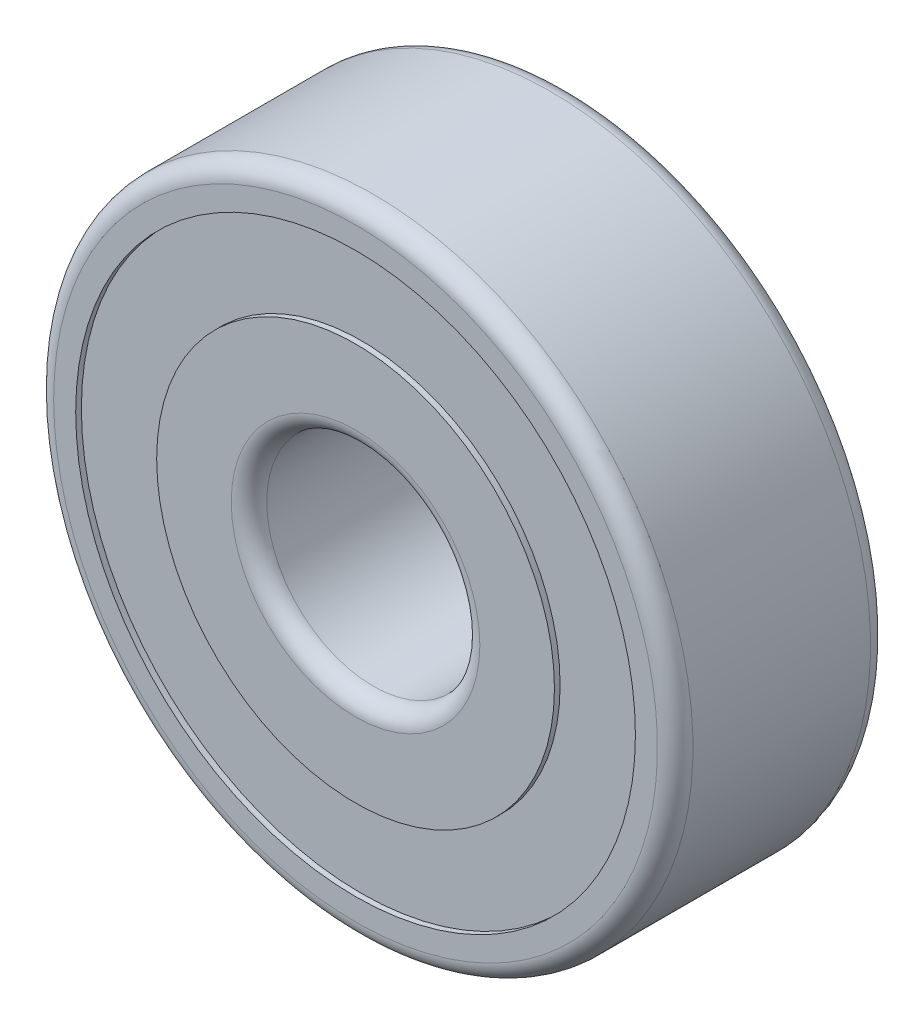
ISO-10303-21;
HEADER;
FILE_DESCRIPTION(('STEP AP214'),'2;1');
FILE_NAME('part.step','',(''),(''),'','','');
FILE_SCHEMA(('AUTOMOTIVE_DESIGN { 1 0 10303 214 1 1 1 1 }'));
ENDSEC;
DATA;
#1=APPLICATION_CONTEXT('core data for automotive mechanical design processes');
#2=APPLICATION_PROTOCOL_DEFINITION('international standard','automotive_design',2000,#1);
#3=PRODUCT_CONTEXT('',#1,'mechanical');
#4=PRODUCT('Part','Part','',(#3));
#5=PRODUCT_RELATED_PRODUCT_CATEGORY('part','',(#4));
#6=PRODUCT_DEFINITION_FORMATION('','',#4);
#7=PRODUCT_DEFINITION_CONTEXT('part definition',#1,'design');
#8=PRODUCT_DEFINITION('design','',#6,#7);
#9=PRODUCT_DEFINITION_SHAPE('','',#8);
#10=(LENGTH_UNIT() NAMED_UNIT(*) SI_UNIT(.MILLI.,.METRE.));
#11=(NAMED_UNIT(*) PLANE_ANGLE_UNIT() SI_UNIT($,.RADIAN.));
#12=(NAMED_UNIT(*) SI_UNIT($,.STERADIAN.) SOLID_ANGLE_UNIT());
#13=UNCERTAINTY_MEASURE_WITH_UNIT(LENGTH_MEASURE(1.E-05),#10,'distance_accuracy_value','');
#14=(GEOMETRIC_REPRESENTATION_CONTEXT(3) GLOBAL_UNCERTAINTY_ASSIGNED_CONTEXT((#13)) GLOBAL_UNIT_ASSIGNED_CONTEXT((#10,
#11,#12)) REPRESENTATION_CONTEXT('',''));
#15=CARTESIAN_POINT('',(0.,0.,0.));
#16=DIRECTION('',(0.,0.,1.));
#17=DIRECTION('',(1.,0.,0.));
#18=AXIS2_PLACEMENT_3D('',#15,#16,#17);
#19=CARTESIAN_POINT('',(0.,0.,4.5085));
#20=DIRECTION('',(0.,0.,1.));
#21=DIRECTION('',(1.,0.,0.));
#22=AXIS2_PLACEMENT_3D('',#19,#20,#21);
#23=CYLINDRICAL_SURFACE('',#22,8.89);
#24=CARTESIAN_POINT('',(0.,0.,-4.5085));
#25=DIRECTION('',(0.,0.,1.));
#26=DIRECTION('',(1.,0.,0.));
#27=AXIS2_PLACEMENT_3D('',#24,#25,#26);
#28=CIRCLE('',#27,8.89);
#29=CARTESIAN_POINT('',(8.89,0.,-4.5085));
#30=VERTEX_POINT('',#29);
#31=EDGE_CURVE('E127',#30,#30,#28,.T.);
#32=ORIENTED_EDGE('',*,*,#31,.F.);
#33=EDGE_LOOP('',(#32));
#34=FACE_BOUND('',#33,.T.);
#35=CARTESIAN_POINT('',(0.,0.,-4.7625));
#36=DIRECTION('',(0.,0.,1.));
#37=DIRECTION('',(1.,0.,0.));
#38=AXIS2_PLACEMENT_3D('',#35,#36,#37);
#39=CIRCLE('',#38,8.89);
#40=CARTESIAN_POINT('',(8.89,0.,-4.7625));
#41=VERTEX_POINT('',#40);
#42=EDGE_CURVE('E57',#41,#41,#39,.T.);
#43=ORIENTED_EDGE('',*,*,#42,.T.);
#44=EDGE_LOOP('',(#43));
#45=FACE_BOUND('',#44,.T.);
#46=ADVANCED_FACE('F17',(#34,#45),#23,.T.);
#47=CARTESIAN_POINT('',(0.,0.,4.5085));
#48=DIRECTION('',(0.,0.,1.));
#49=DIRECTION('',(1.,0.,0.));
#50=AXIS2_PLACEMENT_3D('',#47,#48,#49);
#51=CYLINDRICAL_SURFACE('',#50,12.5095);
#52=CARTESIAN_POINT('',(0.,0.,-4.5085));
#53=DIRECTION('',(0.,0.,1.));
#54=DIRECTION('',(1.,0.,0.));
#55=AXIS2_PLACEMENT_3D('',#52,#53,#54);
#56=CIRCLE('',#55,12.5095);
#57=CARTESIAN_POINT('',(12.5095,0.,-4.5085));
#58=VERTEX_POINT('',#57);
#59=EDGE_CURVE('E129',#58,#58,#56,.T.);
#60=ORIENTED_EDGE('',*,*,#59,.T.);
#61=EDGE_LOOP('',(#60));
#62=FACE_BOUND('',#61,.T.);
#63=CARTESIAN_POINT('',(0.,0.,-4.7625));
#64=DIRECTION('',(0.,0.,1.));
#65=DIRECTION('',(1.,0.,0.));
#66=AXIS2_PLACEMENT_3D('',#63,#64,#65);
#67=CIRCLE('',#66,12.5095);
#68=CARTESIAN_POINT('',(12.5095,0.,-4.7625));
#69=VERTEX_POINT('',#68);
#70=EDGE_CURVE('E115',#69,#69,#67,.T.);
#71=ORIENTED_EDGE('',*,*,#70,.F.);
#72=EDGE_LOOP('',(#71));
#73=FACE_BOUND('',#72,.T.);
#74=ADVANCED_FACE('F161',(#62,#73),#51,.F.);
#75=CARTESIAN_POINT('',(0.,0.,4.5085));
#76=DIRECTION('',(0.,0.,1.));
#77=DIRECTION('',(1.,0.,0.));
#78=AXIS2_PLACEMENT_3D('',#75,#76,#77);
#79=CYLINDRICAL_SURFACE('',#78,8.89);
#80=CARTESIAN_POINT('',(0.,0.,4.5085));
#81=DIRECTION('',(0.,0.,1.));
#82=DIRECTION('',(1.,0.,0.));
#83=AXIS2_PLACEMENT_3D('',#80,#81,#82);
#84=CIRCLE('',#83,8.89);
#85=CARTESIAN_POINT('',(8.89,0.,4.5085));
#86=VERTEX_POINT('',#85);
#87=EDGE_CURVE('E138',#86,#86,#84,.T.);
#88=ORIENTED_EDGE('',*,*,#87,.T.);
#89=EDGE_LOOP('',(#88));
#90=FACE_BOUND('',#89,.T.);
#91=CARTESIAN_POINT('',(0.,0.,4.7625));
#92=DIRECTION('',(0.,0.,1.));
#93=DIRECTION('',(1.,0.,0.));
#94=AXIS2_PLACEMENT_3D('',#91,#92,#93);
#95=CIRCLE('',#94,8.89);
#96=CARTESIAN_POINT('',(8.89,0.,4.7625));
#97=VERTEX_POINT('',#96);
#98=EDGE_CURVE('E77',#97,#97,#95,.T.);
#99=ORIENTED_EDGE('',*,*,#98,.F.);
#100=EDGE_LOOP('',(#99));
#101=FACE_BOUND('',#100,.T.);
#102=ADVANCED_FACE('F19',(#90,#101),#79,.T.);
#103=CARTESIAN_POINT('',(0.,0.,4.5085));
#104=DIRECTION('',(0.,0.,1.));
#105=DIRECTION('',(1.,0.,0.));
#106=AXIS2_PLACEMENT_3D('',#103,#104,#105);
#107=CYLINDRICAL_SURFACE('',#106,12.5095);
#108=CARTESIAN_POINT('',(0.,0.,4.5085));
#109=DIRECTION('',(0.,0.,1.));
#110=DIRECTION('',(1.,0.,0.));
#111=AXIS2_PLACEMENT_3D('',#108,#109,#110);
#112=CIRCLE('',#111,12.5095);
#113=CARTESIAN_POINT('',(12.5095,0.,4.5085));
#114=VERTEX_POINT('',#113);
#115=EDGE_CURVE('E130',#114,#114,#112,.T.);
#116=ORIENTED_EDGE('',*,*,#115,.F.);
#117=EDGE_LOOP('',(#116));
#118=FACE_BOUND('',#117,.T.);
#119=CARTESIAN_POINT('',(0.,0.,4.7625));
#120=DIRECTION('',(0.,0.,1.));
#121=DIRECTION('',(1.,0.,0.));
#122=AXIS2_PLACEMENT_3D('',#119,#120,#121);
#123=CIRCLE('',#122,12.5095);
#124=CARTESIAN_POINT('',(12.5095,0.,4.7625));
#125=VERTEX_POINT('',#124);
#126=EDGE_CURVE('E114',#125,#125,#123,.T.);
#127=ORIENTED_EDGE('',*,*,#126,.T.);
#128=EDGE_LOOP('',(#127));
#129=FACE_BOUND('',#128,.T.);
#130=ADVANCED_FACE('F262',(#118,#129),#107,.F.);
#131=CARTESIAN_POINT('',(0.,0.,-3.96875));
#132=DIRECTION('',(0.,0.,1.));
#133=DIRECTION('',(-1.,0.,0.));
#134=AXIS2_PLACEMENT_3D('',#131,#132,#133);
#135=TOROIDAL_SURFACE('',#134,13.49375,0.79375);
#136=CARTESIAN_POINT('',(0.,0.,-4.7625));
#137=DIRECTION('',(0.,0.,-1.));
#138=DIRECTION('',(-1.,0.,0.));
#139=AXIS2_PLACEMENT_3D('',#136,#137,#138);
#140=CIRCLE('',#139,13.49375);
#141=CARTESIAN_POINT('',(-13.49375,0.,-4.7625));
#142=VERTEX_POINT('',#141);
#143=EDGE_CURVE('E123',#142,#142,#140,.T.);
#144=ORIENTED_EDGE('',*,*,#143,.F.);
#145=EDGE_LOOP('',(#144));
#146=FACE_BOUND('',#145,.T.);
#147=CARTESIAN_POINT('',(0.,0.,-3.96875));
#148=DIRECTION('',(0.,0.,1.));
#149=DIRECTION('',(-1.,0.,0.));
#150=AXIS2_PLACEMENT_3D('',#147,#148,#149);
#151=CIRCLE('',#150,14.2875);
#152=CARTESIAN_POINT('',(-14.2875,0.,-3.96875));
#153=VERTEX_POINT('',#152);
#154=EDGE_CURVE('E11',#153,#153,#151,.T.);
#155=ORIENTED_EDGE('',*,*,#154,.F.);
#156=EDGE_LOOP('',(#155));
#157=FACE_BOUND('',#156,.T.);
#158=ADVANCED_FACE('F243',(#146,#157),#135,.T.);
#159=CARTESIAN_POINT('',(0.,0.,0.));
#160=DIRECTION('',(0.,0.,-1.));
#161=DIRECTION('',(-1.,0.,0.));
#162=AXIS2_PLACEMENT_3D('',#159,#160,#161);
#163=CYLINDRICAL_SURFACE('',#162,14.2875);
#164=CARTESIAN_POINT('',(0.,0.,3.96875));
#165=DIRECTION('',(0.,0.,-1.));
#166=DIRECTION('',(-1.,0.,0.));
#167=AXIS2_PLACEMENT_3D('',#164,#165,#166);
#168=CIRCLE('',#167,14.2875);
#169=CARTESIAN_POINT('',(-14.2875,0.,3.96875));
#170=VERTEX_POINT('',#169);
#171=EDGE_CURVE('E21',#170,#170,#168,.T.);
#172=ORIENTED_EDGE('',*,*,#171,.T.);
#173=EDGE_LOOP('',(#172));
#174=FACE_BOUND('',#173,.T.);
#175=ORIENTED_EDGE('',*,*,#154,.T.);
#176=EDGE_LOOP('',(#175));
#177=FACE_BOUND('',#176,.T.);
#178=ADVANCED_FACE('F238',(#174,#177),#163,.T.);
#179=CARTESIAN_POINT('',(0.,0.,3.96875));
#180=DIRECTION('',(0.,0.,-1.));
#181=DIRECTION('',(1.,0.,0.));
#182=AXIS2_PLACEMENT_3D('',#179,#180,#181);
#183=TOROIDAL_SURFACE('',#182,13.49375,0.79375);
#184=CARTESIAN_POINT('',(0.,0.,4.7625));
#185=DIRECTION('',(0.,0.,1.));
#186=DIRECTION('',(-1.,0.,0.));
#187=AXIS2_PLACEMENT_3D('',#184,#185,#186);
#188=CIRCLE('',#187,13.49375);
#189=CARTESIAN_POINT('',(-13.49375,0.,4.7625));
#190=VERTEX_POINT('',#189);
#191=EDGE_CURVE('E110',#190,#190,#188,.T.);
#192=ORIENTED_EDGE('',*,*,#191,.F.);
#193=EDGE_LOOP('',(#192));
#194=FACE_BOUND('',#193,.T.);
#195=ORIENTED_EDGE('',*,*,#171,.F.);
#196=EDGE_LOOP('',(#195));
#197=FACE_BOUND('',#196,.T.);
#198=ADVANCED_FACE('F242',(#194,#197),#183,.T.);
#199=CARTESIAN_POINT('',(0.,0.,3.96875));
#200=DIRECTION('',(0.,0.,1.));
#201=DIRECTION('',(-1.,0.,0.));
#202=AXIS2_PLACEMENT_3D('',#199,#200,#201);
#203=TOROIDAL_SURFACE('',#202,5.55625,0.79375);
#204=CARTESIAN_POINT('',(0.,0.,4.7625));
#205=DIRECTION('',(0.,0.,1.));
#206=DIRECTION('',(-1.,0.,0.));
#207=AXIS2_PLACEMENT_3D('',#204,#205,#206);
#208=CIRCLE('',#207,5.55625);
#209=CARTESIAN_POINT('',(-5.55625,0.,4.7625));
#210=VERTEX_POINT('',#209);
#211=EDGE_CURVE('E67',#210,#210,#208,.T.);
#212=ORIENTED_EDGE('',*,*,#211,.T.);
#213=EDGE_LOOP('',(#212));
#214=FACE_BOUND('',#213,.T.);
#215=CARTESIAN_POINT('',(0.,0.,3.96875));
#216=DIRECTION('',(0.,0.,-1.));
#217=DIRECTION('',(-1.,0.,0.));
#218=AXIS2_PLACEMENT_3D('',#215,#216,#217);
#219=CIRCLE('',#218,4.7625);
#220=CARTESIAN_POINT('',(-4.7625,0.,3.96875));
#221=VERTEX_POINT('',#220);
#222=EDGE_CURVE('E132',#221,#221,#219,.T.);
#223=ORIENTED_EDGE('',*,*,#222,.T.);
#224=EDGE_LOOP('',(#223));
#225=FACE_BOUND('',#224,.T.);
#226=ADVANCED_FACE('F204',(#214,#225),#203,.T.);
#227=CARTESIAN_POINT('',(0.,0.,0.));
#228=DIRECTION('',(0.,0.,-1.));
#229=DIRECTION('',(-1.,0.,0.));
#230=AXIS2_PLACEMENT_3D('',#227,#228,#229);
#231=CYLINDRICAL_SURFACE('',#230,4.7625);
#232=ORIENTED_EDGE('',*,*,#222,.F.);
#233=EDGE_LOOP('',(#232));
#234=FACE_BOUND('',#233,.T.);
#235=CARTESIAN_POINT('',(0.,0.,-3.96875));
#236=DIRECTION('',(0.,0.,1.));
#237=DIRECTION('',(-1.,0.,0.));
#238=AXIS2_PLACEMENT_3D('',#235,#236,#237);
#239=CIRCLE('',#238,4.7625);
#240=CARTESIAN_POINT('',(-4.7625,0.,-3.96875));
#241=VERTEX_POINT('',#240);
#242=EDGE_CURVE('E135',#241,#241,#239,.T.);
#243=ORIENTED_EDGE('',*,*,#242,.F.);
#244=EDGE_LOOP('',(#243));
#245=FACE_BOUND('',#244,.T.);
#246=ADVANCED_FACE('F199',(#234,#245),#231,.F.);
#247=CARTESIAN_POINT('',(0.,0.,-3.96875));
#248=DIRECTION('',(0.,0.,1.));
#249=DIRECTION('',(-1.,0.,0.));
#250=AXIS2_PLACEMENT_3D('',#247,#248,#249);
#251=TOROIDAL_SURFACE('',#250,5.55625,0.79375);
#252=ORIENTED_EDGE('',*,*,#242,.T.);
#253=EDGE_LOOP('',(#252));
#254=FACE_BOUND('',#253,.T.);
#255=CARTESIAN_POINT('',(0.,0.,-4.7625));
#256=DIRECTION('',(0.,0.,-1.));
#257=DIRECTION('',(-1.,0.,0.));
#258=AXIS2_PLACEMENT_3D('',#255,#256,#257);
#259=CIRCLE('',#258,5.55625);
#260=CARTESIAN_POINT('',(-5.55625,0.,-4.7625));
#261=VERTEX_POINT('',#260);
#262=EDGE_CURVE('E139',#261,#261,#259,.T.);
#263=ORIENTED_EDGE('',*,*,#262,.T.);
#264=EDGE_LOOP('',(#263));
#265=FACE_BOUND('',#264,.T.);
#266=ADVANCED_FACE('F203',(#254,#265),#251,.T.);
#267=CARTESIAN_POINT('',(0.,0.,-4.7625));
#268=DIRECTION('',(0.,0.,1.));
#269=DIRECTION('',(1.,0.,0.));
#270=AXIS2_PLACEMENT_3D('',#267,#268,#269);
#271=PLANE('',#270);
#272=ORIENTED_EDGE('',*,*,#262,.F.);
#273=EDGE_LOOP('',(#272));
#274=FACE_BOUND('',#273,.T.);
#275=ORIENTED_EDGE('',*,*,#42,.F.);
#276=EDGE_LOOP('',(#275));
#277=FACE_BOUND('',#276,.T.);
#278=ADVANCED_FACE('F212',(#274,#277),#271,.F.);
#279=CARTESIAN_POINT('',(0.,0.,4.7625));
#280=DIRECTION('',(0.,0.,1.));
#281=DIRECTION('',(1.,0.,0.));
#282=AXIS2_PLACEMENT_3D('',#279,#280,#281);
#283=PLANE('',#282);
#284=ORIENTED_EDGE('',*,*,#211,.F.);
#285=EDGE_LOOP('',(#284));
#286=FACE_BOUND('',#285,.T.);
#287=ORIENTED_EDGE('',*,*,#98,.T.);
#288=EDGE_LOOP('',(#287));
#289=FACE_BOUND('',#288,.T.);
#290=ADVANCED_FACE('F180',(#286,#289),#283,.T.);
#291=CARTESIAN_POINT('',(0.,0.,4.7625));
#292=DIRECTION('',(0.,0.,1.));
#293=DIRECTION('',(1.,0.,0.));
#294=AXIS2_PLACEMENT_3D('',#291,#292,#293);
#295=PLANE('',#294);
#296=ORIENTED_EDGE('',*,*,#126,.F.);
#297=EDGE_LOOP('',(#296));
#298=FACE_BOUND('',#297,.T.);
#299=ORIENTED_EDGE('',*,*,#191,.T.);
#300=EDGE_LOOP('',(#299));
#301=FACE_BOUND('',#300,.T.);
#302=ADVANCED_FACE('F111',(#298,#301),#295,.T.);
#303=CARTESIAN_POINT('',(0.,0.,-4.7625));
#304=DIRECTION('',(0.,0.,1.));
#305=DIRECTION('',(1.,0.,0.));
#306=AXIS2_PLACEMENT_3D('',#303,#304,#305);
#307=PLANE('',#306);
#308=ORIENTED_EDGE('',*,*,#70,.T.);
#309=EDGE_LOOP('',(#308));
#310=FACE_BOUND('',#309,.T.);
#311=ORIENTED_EDGE('',*,*,#143,.T.);
#312=EDGE_LOOP('',(#311));
#313=FACE_BOUND('',#312,.T.);
#314=ADVANCED_FACE('F179',(#310,#313),#307,.F.);
#315=CARTESIAN_POINT('',(0.,0.,4.5085));
#316=DIRECTION('',(0.,0.,1.));
#317=DIRECTION('',(1.,0.,0.));
#318=AXIS2_PLACEMENT_3D('',#315,#316,#317);
#319=PLANE('',#318);
#320=ORIENTED_EDGE('',*,*,#87,.F.);
#321=EDGE_LOOP('',(#320));
#322=FACE_BOUND('',#321,.T.);
#323=ORIENTED_EDGE('',*,*,#115,.T.);
#324=EDGE_LOOP('',(#323));
#325=FACE_BOUND('',#324,.T.);
#326=ADVANCED_FACE('F171',(#322,#325),#319,.T.);
#327=CARTESIAN_POINT('',(0.,0.,-4.5085));
#328=DIRECTION('',(0.,0.,-1.));
#329=DIRECTION('',(0.,-1.,0.));
#330=AXIS2_PLACEMENT_3D('',#327,#328,#329);
#331=PLANE('',#330);
#332=ORIENTED_EDGE('',*,*,#59,.F.);
#333=EDGE_LOOP('',(#332));
#334=FACE_BOUND('',#333,.T.);
#335=ORIENTED_EDGE('',*,*,#31,.T.);
#336=EDGE_LOOP('',(#335));
#337=FACE_BOUND('',#336,.T.);
#338=ADVANCED_FACE('F167',(#334,#337),#331,.T.);
#339=CLOSED_SHELL('',(#46,#74,#102,#130,#158,#178,#198,#226,#246,#266,#278,#290,#302,#314,#326,#338));
#340=MANIFOLD_SOLID_BREP('B1',#339);
#341=ADVANCED_BREP_SHAPE_REPRESENTATION('',(#18,#340),#14);
#342=SHAPE_DEFINITION_REPRESENTATION(#9,#341);
ENDSEC;
END-ISO-10303-21;
